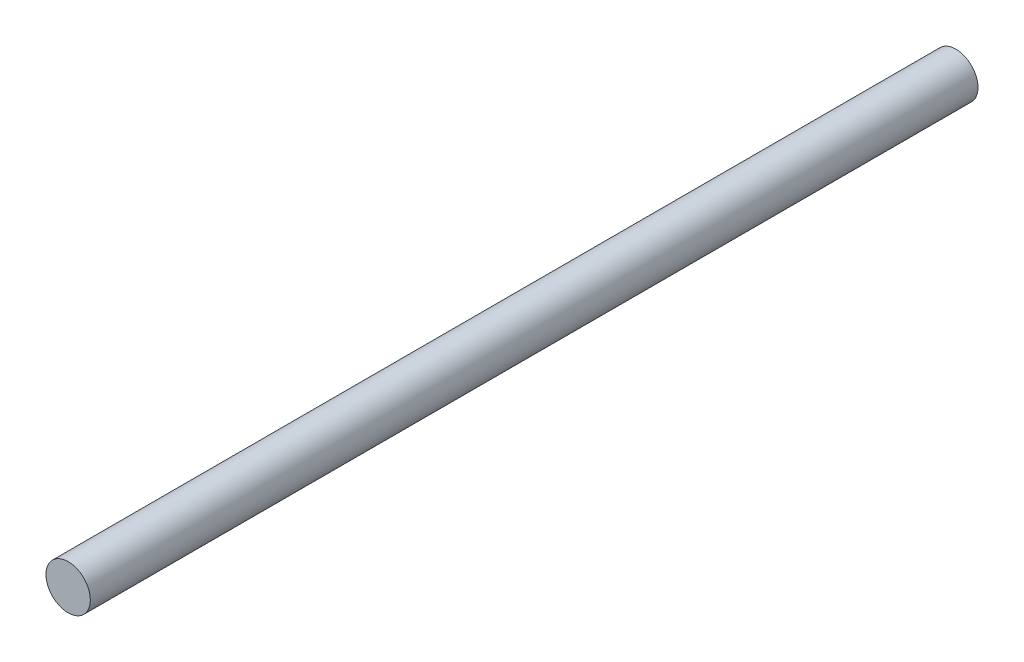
ISO-10303-21;
HEADER;
FILE_DESCRIPTION(('STEP AP214'),'2;1');
FILE_NAME('part.step','',(''),(''),'','','');
FILE_SCHEMA(('AUTOMOTIVE_DESIGN { 1 0 10303 214 1 1 1 1 }'));
ENDSEC;
DATA;
#1=APPLICATION_CONTEXT('core data for automotive mechanical design processes');
#2=APPLICATION_PROTOCOL_DEFINITION('international standard','automotive_design',2000,#1);
#3=PRODUCT_CONTEXT('',#1,'mechanical');
#4=PRODUCT('Part','Part','',(#3));
#5=PRODUCT_RELATED_PRODUCT_CATEGORY('part','',(#4));
#6=PRODUCT_DEFINITION_FORMATION('','',#4);
#7=PRODUCT_DEFINITION_CONTEXT('part definition',#1,'design');
#8=PRODUCT_DEFINITION('design','',#6,#7);
#9=PRODUCT_DEFINITION_SHAPE('','',#8);
#10=(LENGTH_UNIT() NAMED_UNIT(*) SI_UNIT(.MILLI.,.METRE.));
#11=(NAMED_UNIT(*) PLANE_ANGLE_UNIT() SI_UNIT($,.RADIAN.));
#12=(NAMED_UNIT(*) SI_UNIT($,.STERADIAN.) SOLID_ANGLE_UNIT());
#13=UNCERTAINTY_MEASURE_WITH_UNIT(LENGTH_MEASURE(1.E-05),#10,'distance_accuracy_value','');
#14=(GEOMETRIC_REPRESENTATION_CONTEXT(3) GLOBAL_UNCERTAINTY_ASSIGNED_CONTEXT((#13)) GLOBAL_UNIT_ASSIGNED_CONTEXT((#10,
#11,#12)) REPRESENTATION_CONTEXT('',''));
#15=CARTESIAN_POINT('',(0.,0.,0.));
#16=DIRECTION('',(0.,0.,1.));
#17=DIRECTION('',(1.,0.,0.));
#18=AXIS2_PLACEMENT_3D('',#15,#16,#17);
#19=CARTESIAN_POINT('',(0.,0.,-1200.));
#20=DIRECTION('',(0.,0.,1.));
#21=DIRECTION('',(1.,0.,0.));
#22=AXIS2_PLACEMENT_3D('',#19,#20,#21);
#23=CYLINDRICAL_SURFACE('',#22,30.);
#24=CARTESIAN_POINT('',(0.,0.,-1200.));
#25=DIRECTION('',(0.,0.,1.));
#26=DIRECTION('',(1.,0.,0.));
#27=AXIS2_PLACEMENT_3D('',#24,#25,#26);
#28=CIRCLE('',#27,30.);
#29=CARTESIAN_POINT('',(30.,0.,-1200.));
#30=VERTEX_POINT('',#29);
#31=EDGE_CURVE('E10',#30,#30,#28,.T.);
#32=ORIENTED_EDGE('',*,*,#31,.T.);
#33=EDGE_LOOP('',(#32));
#34=FACE_BOUND('',#33,.T.);
#35=CARTESIAN_POINT('',(0.,0.,0.));
#36=DIRECTION('',(0.,0.,1.));
#37=DIRECTION('',(1.,0.,0.));
#38=AXIS2_PLACEMENT_3D('',#35,#36,#37);
#39=CIRCLE('',#38,30.);
#40=CARTESIAN_POINT('',(30.,0.,0.));
#41=VERTEX_POINT('',#40);
#42=EDGE_CURVE('E40',#41,#41,#39,.T.);
#43=ORIENTED_EDGE('',*,*,#42,.F.);
#44=EDGE_LOOP('',(#43));
#45=FACE_BOUND('',#44,.T.);
#46=ADVANCED_FACE('F37',(#34,#45),#23,.T.);
#47=CARTESIAN_POINT('',(0.,0.,-1200.));
#48=DIRECTION('',(0.,0.,1.));
#49=DIRECTION('',(1.,0.,0.));
#50=AXIS2_PLACEMENT_3D('',#47,#48,#49);
#51=PLANE('',#50);
#52=ORIENTED_EDGE('',*,*,#31,.F.);
#53=EDGE_LOOP('',(#52));
#54=FACE_BOUND('',#53,.T.);
#55=ADVANCED_FACE('F54',(#54),#51,.F.);
#56=CARTESIAN_POINT('',(0.,0.,0.));
#57=DIRECTION('',(0.,0.,1.));
#58=DIRECTION('',(1.,0.,0.));
#59=AXIS2_PLACEMENT_3D('',#56,#57,#58);
#60=PLANE('',#59);
#61=ORIENTED_EDGE('',*,*,#42,.T.);
#62=EDGE_LOOP('',(#61));
#63=FACE_BOUND('',#62,.T.);
#64=ADVANCED_FACE('F51',(#63),#60,.T.);
#65=CLOSED_SHELL('',(#46,#55,#64));
#66=MANIFOLD_SOLID_BREP('B2',#65);
#67=ADVANCED_BREP_SHAPE_REPRESENTATION('',(#18,#66),#14);
#68=SHAPE_DEFINITION_REPRESENTATION(#9,#67);
ENDSEC;
END-ISO-10303-21;
